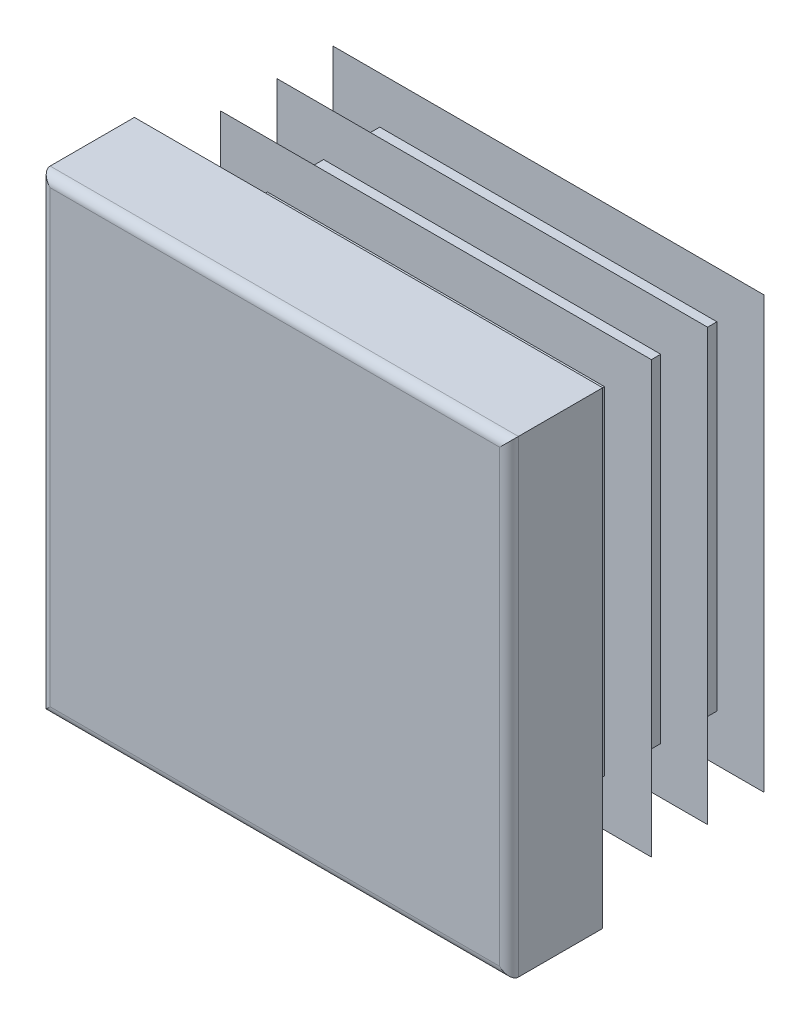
ISO-10303-21;
HEADER;
FILE_DESCRIPTION(('STEP AP214'),'2;1');
FILE_NAME('part.step','',(''),(''),'','','');
FILE_SCHEMA(('AUTOMOTIVE_DESIGN { 1 0 10303 214 1 1 1 1 }'));
ENDSEC;
DATA;
#1=APPLICATION_CONTEXT('core data for automotive mechanical design processes');
#2=APPLICATION_PROTOCOL_DEFINITION('international standard','automotive_design',2000,#1);
#3=PRODUCT_CONTEXT('',#1,'mechanical');
#4=PRODUCT('Part','Part','',(#3));
#5=PRODUCT_RELATED_PRODUCT_CATEGORY('part','',(#4));
#6=PRODUCT_DEFINITION_FORMATION('','',#4);
#7=PRODUCT_DEFINITION_CONTEXT('part definition',#1,'design');
#8=PRODUCT_DEFINITION('design','',#6,#7);
#9=PRODUCT_DEFINITION_SHAPE('','',#8);
#10=(LENGTH_UNIT() NAMED_UNIT(*) SI_UNIT(.MILLI.,.METRE.));
#11=(NAMED_UNIT(*) PLANE_ANGLE_UNIT() SI_UNIT($,.RADIAN.));
#12=(NAMED_UNIT(*) SI_UNIT($,.STERADIAN.) SOLID_ANGLE_UNIT());
#13=UNCERTAINTY_MEASURE_WITH_UNIT(LENGTH_MEASURE(1.E-05),#10,'distance_accuracy_value','');
#14=(GEOMETRIC_REPRESENTATION_CONTEXT(3) GLOBAL_UNCERTAINTY_ASSIGNED_CONTEXT((#13)) GLOBAL_UNIT_ASSIGNED_CONTEXT((#10,
#11,#12)) REPRESENTATION_CONTEXT('',''));
#15=CARTESIAN_POINT('',(0.,0.,0.));
#16=DIRECTION('',(0.,0.,1.));
#17=DIRECTION('',(1.,0.,0.));
#18=AXIS2_PLACEMENT_3D('',#15,#16,#17);
#19=CARTESIAN_POINT('',(12.,-12.5,5.));
#20=DIRECTION('',(0.,0.,-1.));
#21=DIRECTION('',(0.,1.,0.));
#22=AXIS2_PLACEMENT_3D('',#19,#20,#21);
#23=PLANE('',#22);
#24=DIRECTION('',(0.,1.,0.));
#25=VECTOR('',#24,1.);
#26=CARTESIAN_POINT('',(-12.,-12.5,5.));
#27=LINE('',#26,#25);
#28=CARTESIAN_POINT('',(-12.,-12.,5.));
#29=VERTEX_POINT('',#28);
#30=CARTESIAN_POINT('',(-12.,12.,5.));
#31=VERTEX_POINT('',#30);
#32=EDGE_CURVE('E262',#29,#31,#27,.T.);
#33=ORIENTED_EDGE('',*,*,#32,.F.);
#34=DIRECTION('',(-1.,0.,0.));
#35=VECTOR('',#34,1.);
#36=CARTESIAN_POINT('',(12.5,-12.,5.));
#37=LINE('',#36,#35);
#38=CARTESIAN_POINT('',(12.,-12.,5.));
#39=VERTEX_POINT('',#38);
#40=EDGE_CURVE('E432',#39,#29,#37,.T.);
#41=ORIENTED_EDGE('',*,*,#40,.F.);
#42=DIRECTION('',(0.,1.,0.));
#43=VECTOR('',#42,1.);
#44=CARTESIAN_POINT('',(12.,-12.5,5.));
#45=LINE('',#44,#43);
#46=CARTESIAN_POINT('',(12.,12.,5.));
#47=VERTEX_POINT('',#46);
#48=EDGE_CURVE('E257',#39,#47,#45,.T.);
#49=ORIENTED_EDGE('',*,*,#48,.T.);
#50=DIRECTION('',(-1.,0.,0.));
#51=VECTOR('',#50,1.);
#52=CARTESIAN_POINT('',(12.5,12.,5.));
#53=LINE('',#52,#51);
#54=EDGE_CURVE('E534',#47,#31,#53,.T.);
#55=ORIENTED_EDGE('',*,*,#54,.T.);
#56=EDGE_LOOP('',(#33,#41,#49,#55));
#57=FACE_BOUND('',#56,.T.);
#58=ADVANCED_FACE('F14',(#57),#23,.F.);
#59=CARTESIAN_POINT('',(-12.,-12.5,4.5));
#60=DIRECTION('',(0.,1.,0.));
#61=DIRECTION('',(-1.,0.,0.));
#62=AXIS2_PLACEMENT_3D('',#59,#60,#61);
#63=CYLINDRICAL_SURFACE('',#62,0.5);
#64=DIRECTION('',(0.,1.,0.));
#65=VECTOR('',#64,1.);
#66=CARTESIAN_POINT('',(-12.5,-12.5,4.5));
#67=LINE('',#66,#65);
#68=CARTESIAN_POINT('',(-12.5,-12.5,4.5));
#69=VERTEX_POINT('',#68);
#70=CARTESIAN_POINT('',(-12.5,12.5,4.5));
#71=VERTEX_POINT('',#70);
#72=EDGE_CURVE('E354',#69,#71,#67,.T.);
#73=ORIENTED_EDGE('',*,*,#72,.F.);
#74=CARTESIAN_POINT('',(-12.,-12.,4.5));
#75=DIRECTION('',(-0.707106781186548,0.707106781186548,0.));
#76=DIRECTION('',(0.707106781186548,0.707106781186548,0.));
#77=AXIS2_PLACEMENT_3D('',#74,#75,#76);
#78=ELLIPSE('',#77,0.707106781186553,0.5);
#79=EDGE_CURVE('E59',#69,#29,#78,.T.);
#80=ORIENTED_EDGE('',*,*,#79,.T.);
#81=ORIENTED_EDGE('',*,*,#32,.T.);
#82=CARTESIAN_POINT('',(-12.,12.,4.5));
#83=DIRECTION('',(0.707106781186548,0.707106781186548,0.));
#84=DIRECTION('',(-0.707106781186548,0.707106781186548,0.));
#85=AXIS2_PLACEMENT_3D('',#82,#83,#84);
#86=ELLIPSE('',#85,0.707106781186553,0.5);
#87=EDGE_CURVE('E258',#31,#71,#86,.F.);
#88=ORIENTED_EDGE('',*,*,#87,.T.);
#89=EDGE_LOOP('',(#73,#80,#81,#88));
#90=FACE_BOUND('',#89,.T.);
#91=ADVANCED_FACE('F16',(#90),#63,.T.);
#92=CARTESIAN_POINT('',(-12.5,-12.5,4.5));
#93=DIRECTION('',(1.,0.,0.));
#94=DIRECTION('',(0.,1.,0.));
#95=AXIS2_PLACEMENT_3D('',#92,#93,#94);
#96=PLANE('',#95);
#97=DIRECTION('',(0.,0.,-1.));
#98=VECTOR('',#97,1.);
#99=CARTESIAN_POINT('',(-12.5,12.5,4.5));
#100=LINE('',#99,#98);
#101=CARTESIAN_POINT('',(-12.5,12.5,0.));
#102=VERTEX_POINT('',#101);
#103=EDGE_CURVE('E519',#71,#102,#100,.T.);
#104=ORIENTED_EDGE('',*,*,#103,.T.);
#105=DIRECTION('',(0.,1.,0.));
#106=VECTOR('',#105,1.);
#107=CARTESIAN_POINT('',(-12.5,-12.5,0.));
#108=LINE('',#107,#106);
#109=CARTESIAN_POINT('',(-12.5,-12.5,0.));
#110=VERTEX_POINT('',#109);
#111=EDGE_CURVE('E352',#110,#102,#108,.T.);
#112=ORIENTED_EDGE('',*,*,#111,.F.);
#113=DIRECTION('',(0.,0.,-1.));
#114=VECTOR('',#113,1.);
#115=CARTESIAN_POINT('',(-12.5,-12.5,4.5));
#116=LINE('',#115,#114);
#117=EDGE_CURVE('E520',#69,#110,#116,.T.);
#118=ORIENTED_EDGE('',*,*,#117,.F.);
#119=ORIENTED_EDGE('',*,*,#72,.T.);
#120=EDGE_LOOP('',(#104,#112,#118,#119));
#121=FACE_BOUND('',#120,.T.);
#122=ADVANCED_FACE('F604',(#121),#96,.F.);
#123=CARTESIAN_POINT('',(-9.,-12.5,0.));
#124=DIRECTION('',(1.,0.,0.));
#125=DIRECTION('',(0.,1.,0.));
#126=AXIS2_PLACEMENT_3D('',#123,#124,#125);
#127=PLANE('',#126);
#128=DIRECTION('',(0.,1.,0.));
#129=VECTOR('',#128,1.);
#130=CARTESIAN_POINT('',(-9.,-12.5,0.));
#131=LINE('',#130,#129);
#132=CARTESIAN_POINT('',(-9.,-9.,0.));
#133=VERTEX_POINT('',#132);
#134=CARTESIAN_POINT('',(-9.,9.,0.));
#135=VERTEX_POINT('',#134);
#136=EDGE_CURVE('E349',#133,#135,#131,.T.);
#137=ORIENTED_EDGE('',*,*,#136,.T.);
#138=DIRECTION('',(0.,0.,-1.));
#139=VECTOR('',#138,1.);
#140=CARTESIAN_POINT('',(-9.,9.,0.));
#141=LINE('',#140,#139);
#142=CARTESIAN_POINT('',(-9.,9.,-0.6));
#143=VERTEX_POINT('',#142);
#144=EDGE_CURVE('E445',#135,#143,#141,.T.);
#145=ORIENTED_EDGE('',*,*,#144,.T.);
#146=DIRECTION('',(0.,1.,0.));
#147=VECTOR('',#146,1.);
#148=CARTESIAN_POINT('',(-9.,-12.5,-0.6));
#149=LINE('',#148,#147);
#150=CARTESIAN_POINT('',(-9.,-9.,-0.6));
#151=VERTEX_POINT('',#150);
#152=EDGE_CURVE('E346',#151,#143,#149,.T.);
#153=ORIENTED_EDGE('',*,*,#152,.F.);
#154=DIRECTION('',(0.,0.,1.));
#155=VECTOR('',#154,1.);
#156=CARTESIAN_POINT('',(-9.,-9.,0.));
#157=LINE('',#156,#155);
#158=EDGE_CURVE('E439',#151,#133,#157,.T.);
#159=ORIENTED_EDGE('',*,*,#158,.T.);
#160=EDGE_LOOP('',(#137,#145,#153,#159));
#161=FACE_BOUND('',#160,.T.);
#162=ADVANCED_FACE('F728',(#161),#127,.F.);
#163=CARTESIAN_POINT('',(-11.5,-12.5,-0.6));
#164=DIRECTION('',(0.573576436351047,0.,0.819152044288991));
#165=DIRECTION('',(-0.819152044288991,0.,0.573576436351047));
#166=AXIS2_PLACEMENT_3D('',#163,#164,#165);
#167=PLANE('',#166);
#168=DIRECTION('',(0.,1.,0.));
#169=VECTOR('',#168,1.);
#170=CARTESIAN_POINT('',(-11.5,-12.5,-0.6));
#171=LINE('',#170,#169);
#172=CARTESIAN_POINT('',(-11.5,-11.5,-0.6));
#173=VERTEX_POINT('',#172);
#174=CARTESIAN_POINT('',(-11.5,11.5,-0.6));
#175=VERTEX_POINT('',#174);
#176=EDGE_CURVE('E344',#173,#175,#171,.T.);
#177=ORIENTED_EDGE('',*,*,#176,.T.);
#178=DIRECTION('',(0.633687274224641,-0.633687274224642,-0.443712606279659));
#179=VECTOR('',#178,1.);
#180=CARTESIAN_POINT('',(-1.86257052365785,1.86257052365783,-7.34820076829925));
#181=LINE('',#180,#179);
#182=CARTESIAN_POINT('',(-9.,9.,-2.35051884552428));
#183=VERTEX_POINT('',#182);
#184=EDGE_CURVE('E457',#175,#183,#181,.T.);
#185=ORIENTED_EDGE('',*,*,#184,.T.);
#186=DIRECTION('',(0.,1.,0.));
#187=VECTOR('',#186,1.);
#188=CARTESIAN_POINT('',(-9.,-12.5,-2.35051884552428));
#189=LINE('',#188,#187);
#190=CARTESIAN_POINT('',(-9.,-9.,-2.35051884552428));
#191=VERTEX_POINT('',#190);
#192=EDGE_CURVE('E341',#191,#183,#189,.T.);
#193=ORIENTED_EDGE('',*,*,#192,.F.);
#194=DIRECTION('',(-0.633687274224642,-0.633687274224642,0.443712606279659));
#195=VECTOR('',#194,1.);
#196=CARTESIAN_POINT('',(-11.9015595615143,-11.9015595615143,-0.31882496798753));
#197=LINE('',#196,#195);
#198=EDGE_CURVE('E451',#191,#173,#197,.T.);
#199=ORIENTED_EDGE('',*,*,#198,.T.);
#200=EDGE_LOOP('',(#177,#185,#193,#199));
#201=FACE_BOUND('',#200,.T.);
#202=ADVANCED_FACE('F732',(#201),#167,.F.);
#203=CARTESIAN_POINT('',(-9.,-12.5,-2.35051884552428));
#204=DIRECTION('',(1.,0.,0.));
#205=DIRECTION('',(0.,1.,0.));
#206=AXIS2_PLACEMENT_3D('',#203,#204,#205);
#207=PLANE('',#206);
#208=ORIENTED_EDGE('',*,*,#192,.T.);
#209=DIRECTION('',(0.,0.,-1.));
#210=VECTOR('',#209,1.);
#211=CARTESIAN_POINT('',(-9.,9.,-2.35051884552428));
#212=LINE('',#211,#210);
#213=CARTESIAN_POINT('',(-9.,9.,-3.6));
#214=VERTEX_POINT('',#213);
#215=EDGE_CURVE('E463',#183,#214,#212,.T.);
#216=ORIENTED_EDGE('',*,*,#215,.T.);
#217=DIRECTION('',(0.,1.,0.));
#218=VECTOR('',#217,1.);
#219=CARTESIAN_POINT('',(-9.,-12.5,-3.6));
#220=LINE('',#219,#218);
#221=CARTESIAN_POINT('',(-9.,-9.,-3.6));
#222=VERTEX_POINT('',#221);
#223=EDGE_CURVE('E338',#222,#214,#220,.T.);
#224=ORIENTED_EDGE('',*,*,#223,.F.);
#225=DIRECTION('',(0.,0.,1.));
#226=VECTOR('',#225,1.);
#227=CARTESIAN_POINT('',(-9.,-9.,-2.35051884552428));
#228=LINE('',#227,#226);
#229=EDGE_CURVE('E460',#222,#191,#228,.T.);
#230=ORIENTED_EDGE('',*,*,#229,.T.);
#231=EDGE_LOOP('',(#208,#216,#224,#230));
#232=FACE_BOUND('',#231,.T.);
#233=ADVANCED_FACE('F738',(#232),#207,.F.);
#234=CARTESIAN_POINT('',(-11.5,-12.5,-3.6));
#235=DIRECTION('',(0.573576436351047,0.,0.819152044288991));
#236=DIRECTION('',(-0.819152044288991,0.,0.573576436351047));
#237=AXIS2_PLACEMENT_3D('',#234,#235,#236);
#238=PLANE('',#237);
#239=DIRECTION('',(0.,1.,0.));
#240=VECTOR('',#239,1.);
#241=CARTESIAN_POINT('',(-11.5,-12.5,-3.6));
#242=LINE('',#241,#240);
#243=CARTESIAN_POINT('',(-11.5,-11.5,-3.6));
#244=VERTEX_POINT('',#243);
#245=CARTESIAN_POINT('',(-11.5,11.5,-3.6));
#246=VERTEX_POINT('',#245);
#247=EDGE_CURVE('E336',#244,#246,#242,.T.);
#248=ORIENTED_EDGE('',*,*,#247,.T.);
#249=DIRECTION('',(0.633687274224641,-0.633687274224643,-0.443712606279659));
#250=VECTOR('',#249,1.);
#251=CARTESIAN_POINT('',(-1.86257052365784,1.86257052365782,-10.3482007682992));
#252=LINE('',#251,#250);
#253=CARTESIAN_POINT('',(-9.,9.,-5.35051884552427));
#254=VERTEX_POINT('',#253);
#255=EDGE_CURVE('E475',#246,#254,#252,.T.);
#256=ORIENTED_EDGE('',*,*,#255,.T.);
#257=DIRECTION('',(0.,1.,0.));
#258=VECTOR('',#257,1.);
#259=CARTESIAN_POINT('',(-9.,-12.5,-5.35051884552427));
#260=LINE('',#259,#258);
#261=CARTESIAN_POINT('',(-9.,-9.,-5.35051884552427));
#262=VERTEX_POINT('',#261);
#263=EDGE_CURVE('E333',#262,#254,#260,.T.);
#264=ORIENTED_EDGE('',*,*,#263,.F.);
#265=DIRECTION('',(-0.633687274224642,-0.633687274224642,0.443712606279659));
#266=VECTOR('',#265,1.);
#267=CARTESIAN_POINT('',(-11.9015595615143,-11.9015595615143,-3.31882496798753));
#268=LINE('',#267,#266);
#269=EDGE_CURVE('E469',#262,#244,#268,.T.);
#270=ORIENTED_EDGE('',*,*,#269,.T.);
#271=EDGE_LOOP('',(#248,#256,#264,#270));
#272=FACE_BOUND('',#271,.T.);
#273=ADVANCED_FACE('F742',(#272),#238,.F.);
#274=CARTESIAN_POINT('',(-9.,-12.5,-5.35051884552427));
#275=DIRECTION('',(1.,0.,0.));
#276=DIRECTION('',(0.,1.,0.));
#277=AXIS2_PLACEMENT_3D('',#274,#275,#276);
#278=PLANE('',#277);
#279=ORIENTED_EDGE('',*,*,#263,.T.);
#280=DIRECTION('',(0.,0.,-1.));
#281=VECTOR('',#280,1.);
#282=CARTESIAN_POINT('',(-9.,9.,-5.35051884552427));
#283=LINE('',#282,#281);
#284=CARTESIAN_POINT('',(-9.,9.,-6.6));
#285=VERTEX_POINT('',#284);
#286=EDGE_CURVE('E481',#254,#285,#283,.T.);
#287=ORIENTED_EDGE('',*,*,#286,.T.);
#288=DIRECTION('',(0.,1.,0.));
#289=VECTOR('',#288,1.);
#290=CARTESIAN_POINT('',(-9.,-12.5,-6.6));
#291=LINE('',#290,#289);
#292=CARTESIAN_POINT('',(-9.,-9.,-6.6));
#293=VERTEX_POINT('',#292);
#294=EDGE_CURVE('E330',#293,#285,#291,.T.);
#295=ORIENTED_EDGE('',*,*,#294,.F.);
#296=DIRECTION('',(0.,0.,1.));
#297=VECTOR('',#296,1.);
#298=CARTESIAN_POINT('',(-9.,-9.,-5.35051884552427));
#299=LINE('',#298,#297);
#300=EDGE_CURVE('E478',#293,#262,#299,.T.);
#301=ORIENTED_EDGE('',*,*,#300,.T.);
#302=EDGE_LOOP('',(#279,#287,#295,#301));
#303=FACE_BOUND('',#302,.T.);
#304=ADVANCED_FACE('F746',(#303),#278,.F.);
#305=CARTESIAN_POINT('',(-11.5,-12.5,-6.6));
#306=DIRECTION('',(0.573576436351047,0.,0.819152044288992));
#307=DIRECTION('',(-0.819152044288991,0.,0.573576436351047));
#308=AXIS2_PLACEMENT_3D('',#305,#306,#307);
#309=PLANE('',#308);
#310=DIRECTION('',(0.,1.,0.));
#311=VECTOR('',#310,1.);
#312=CARTESIAN_POINT('',(-11.5,-12.5,-6.6));
#313=LINE('',#312,#311);
#314=CARTESIAN_POINT('',(-11.5,-11.5,-6.6));
#315=VERTEX_POINT('',#314);
#316=CARTESIAN_POINT('',(-11.5,11.5,-6.6));
#317=VERTEX_POINT('',#316);
#318=EDGE_CURVE('E328',#315,#317,#313,.T.);
#319=ORIENTED_EDGE('',*,*,#318,.T.);
#320=DIRECTION('',(0.633687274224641,-0.633687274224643,-0.443712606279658));
#321=VECTOR('',#320,1.);
#322=CARTESIAN_POINT('',(-1.86257052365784,1.86257052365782,-13.3482007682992));
#323=LINE('',#322,#321);
#324=CARTESIAN_POINT('',(-9.,9.,-8.35051884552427));
#325=VERTEX_POINT('',#324);
#326=EDGE_CURVE('E493',#317,#325,#323,.T.);
#327=ORIENTED_EDGE('',*,*,#326,.T.);
#328=DIRECTION('',(0.,1.,0.));
#329=VECTOR('',#328,1.);
#330=CARTESIAN_POINT('',(-9.,-12.5,-8.35051884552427));
#331=LINE('',#330,#329);
#332=CARTESIAN_POINT('',(-9.,-9.,-8.35051884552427));
#333=VERTEX_POINT('',#332);
#334=EDGE_CURVE('E325',#333,#325,#331,.T.);
#335=ORIENTED_EDGE('',*,*,#334,.F.);
#336=DIRECTION('',(-0.633687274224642,-0.633687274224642,0.443712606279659));
#337=VECTOR('',#336,1.);
#338=CARTESIAN_POINT('',(-11.9015595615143,-11.9015595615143,-6.31882496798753));
#339=LINE('',#338,#337);
#340=EDGE_CURVE('E487',#333,#315,#339,.T.);
#341=ORIENTED_EDGE('',*,*,#340,.T.);
#342=EDGE_LOOP('',(#319,#327,#335,#341));
#343=FACE_BOUND('',#342,.T.);
#344=ADVANCED_FACE('F668',(#343),#309,.F.);
#345=CARTESIAN_POINT('',(-9.,-12.5,-8.35051884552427));
#346=DIRECTION('',(1.,0.,0.));
#347=DIRECTION('',(0.,1.,0.));
#348=AXIS2_PLACEMENT_3D('',#345,#346,#347);
#349=PLANE('',#348);
#350=ORIENTED_EDGE('',*,*,#334,.T.);
#351=DIRECTION('',(0.,0.,-1.));
#352=VECTOR('',#351,1.);
#353=CARTESIAN_POINT('',(-9.,9.,-8.35051884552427));
#354=LINE('',#353,#352);
#355=CARTESIAN_POINT('',(-9.,9.,-9.6));
#356=VERTEX_POINT('',#355);
#357=EDGE_CURVE('E499',#325,#356,#354,.T.);
#358=ORIENTED_EDGE('',*,*,#357,.T.);
#359=DIRECTION('',(0.,1.,0.));
#360=VECTOR('',#359,1.);
#361=CARTESIAN_POINT('',(-9.,-12.5,-9.6));
#362=LINE('',#361,#360);
#363=CARTESIAN_POINT('',(-9.,-9.,-9.6));
#364=VERTEX_POINT('',#363);
#365=EDGE_CURVE('E322',#364,#356,#362,.T.);
#366=ORIENTED_EDGE('',*,*,#365,.F.);
#367=DIRECTION('',(0.,0.,1.));
#368=VECTOR('',#367,1.);
#369=CARTESIAN_POINT('',(-9.,-9.,-8.35051884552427));
#370=LINE('',#369,#368);
#371=EDGE_CURVE('E496',#364,#333,#370,.T.);
#372=ORIENTED_EDGE('',*,*,#371,.T.);
#373=EDGE_LOOP('',(#350,#358,#366,#372));
#374=FACE_BOUND('',#373,.T.);
#375=ADVANCED_FACE('F665',(#374),#349,.F.);
#376=CARTESIAN_POINT('',(-11.5,-12.5,-9.6));
#377=DIRECTION('',(0.573576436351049,0.,0.81915204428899));
#378=DIRECTION('',(-0.81915204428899,0.,0.573576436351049));
#379=AXIS2_PLACEMENT_3D('',#376,#377,#378);
#380=PLANE('',#379);
#381=DIRECTION('',(0.,1.,0.));
#382=VECTOR('',#381,1.);
#383=CARTESIAN_POINT('',(-11.5,-12.5,-9.6));
#384=LINE('',#383,#382);
#385=CARTESIAN_POINT('',(-11.5,-11.5,-9.6));
#386=VERTEX_POINT('',#385);
#387=CARTESIAN_POINT('',(-11.5,11.5,-9.6));
#388=VERTEX_POINT('',#387);
#389=EDGE_CURVE('E320',#386,#388,#384,.T.);
#390=ORIENTED_EDGE('',*,*,#389,.T.);
#391=DIRECTION('',(0.63368727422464,-0.633687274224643,-0.44371260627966));
#392=VECTOR('',#391,1.);
#393=CARTESIAN_POINT('',(-1.86257052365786,1.8625705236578,-16.3482007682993));
#394=LINE('',#393,#392);
#395=CARTESIAN_POINT('',(-9.,9.,-11.3505188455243));
#396=VERTEX_POINT('',#395);
#397=EDGE_CURVE('E511',#388,#396,#394,.T.);
#398=ORIENTED_EDGE('',*,*,#397,.T.);
#399=DIRECTION('',(0.,1.,0.));
#400=VECTOR('',#399,1.);
#401=CARTESIAN_POINT('',(-9.,-12.5,-11.3505188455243));
#402=LINE('',#401,#400);
#403=CARTESIAN_POINT('',(-9.,-9.,-11.3505188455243));
#404=VERTEX_POINT('',#403);
#405=EDGE_CURVE('E317',#404,#396,#402,.T.);
#406=ORIENTED_EDGE('',*,*,#405,.F.);
#407=DIRECTION('',(-0.633687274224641,-0.633687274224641,0.443712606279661));
#408=VECTOR('',#407,1.);
#409=CARTESIAN_POINT('',(-11.9015595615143,-11.9015595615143,-9.31882496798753));
#410=LINE('',#409,#408);
#411=EDGE_CURVE('E505',#404,#386,#410,.T.);
#412=ORIENTED_EDGE('',*,*,#411,.T.);
#413=EDGE_LOOP('',(#390,#398,#406,#412));
#414=FACE_BOUND('',#413,.T.);
#415=ADVANCED_FACE('F580',(#414),#380,.F.);
#416=CARTESIAN_POINT('',(-9.,-12.5,-11.3505188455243));
#417=DIRECTION('',(1.,0.,0.));
#418=DIRECTION('',(0.,1.,0.));
#419=AXIS2_PLACEMENT_3D('',#416,#417,#418);
#420=PLANE('',#419);
#421=ORIENTED_EDGE('',*,*,#405,.T.);
#422=DIRECTION('',(0.,0.,-1.));
#423=VECTOR('',#422,1.);
#424=CARTESIAN_POINT('',(-9.,9.,-11.3505188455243));
#425=LINE('',#424,#423);
#426=CARTESIAN_POINT('',(-9.,9.,-12.));
#427=VERTEX_POINT('',#426);
#428=EDGE_CURVE('E517',#396,#427,#425,.T.);
#429=ORIENTED_EDGE('',*,*,#428,.T.);
#430=DIRECTION('',(0.,1.,0.));
#431=VECTOR('',#430,1.);
#432=CARTESIAN_POINT('',(-9.,-12.5,-12.));
#433=LINE('',#432,#431);
#434=CARTESIAN_POINT('',(-9.,-9.,-12.));
#435=VERTEX_POINT('',#434);
#436=EDGE_CURVE('E314',#435,#427,#433,.T.);
#437=ORIENTED_EDGE('',*,*,#436,.F.);
#438=DIRECTION('',(0.,0.,1.));
#439=VECTOR('',#438,1.);
#440=CARTESIAN_POINT('',(-9.,-9.,-11.3505188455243));
#441=LINE('',#440,#439);
#442=EDGE_CURVE('E514',#435,#404,#441,.T.);
#443=ORIENTED_EDGE('',*,*,#442,.T.);
#444=EDGE_LOOP('',(#421,#429,#437,#443));
#445=FACE_BOUND('',#444,.T.);
#446=ADVANCED_FACE('F582',(#445),#420,.F.);
#447=CARTESIAN_POINT('',(-9.,-12.5,-12.));
#448=DIRECTION('',(0.,0.,1.));
#449=DIRECTION('',(0.,-1.,0.));
#450=AXIS2_PLACEMENT_3D('',#447,#448,#449);
#451=PLANE('',#450);
#452=ORIENTED_EDGE('',*,*,#436,.T.);
#453=DIRECTION('',(-1.,0.,0.));
#454=VECTOR('',#453,1.);
#455=CARTESIAN_POINT('',(12.5,9.,-12.));
#456=LINE('',#455,#454);
#457=CARTESIAN_POINT('',(9.,9.,-12.));
#458=VERTEX_POINT('',#457);
#459=EDGE_CURVE('E388',#458,#427,#456,.T.);
#460=ORIENTED_EDGE('',*,*,#459,.F.);
#461=DIRECTION('',(0.,1.,0.));
#462=VECTOR('',#461,1.);
#463=CARTESIAN_POINT('',(9.,-12.5,-12.));
#464=LINE('',#463,#462);
#465=CARTESIAN_POINT('',(9.,-9.,-12.));
#466=VERTEX_POINT('',#465);
#467=EDGE_CURVE('E311',#466,#458,#464,.T.);
#468=ORIENTED_EDGE('',*,*,#467,.F.);
#469=DIRECTION('',(-1.,0.,0.));
#470=VECTOR('',#469,1.);
#471=CARTESIAN_POINT('',(12.5,-9.,-12.));
#472=LINE('',#471,#470);
#473=EDGE_CURVE('E386',#466,#435,#472,.T.);
#474=ORIENTED_EDGE('',*,*,#473,.T.);
#475=EDGE_LOOP('',(#452,#460,#468,#474));
#476=FACE_BOUND('',#475,.T.);
#477=ADVANCED_FACE('F385',(#476),#451,.F.);
#478=CARTESIAN_POINT('',(9.,-12.5,-12.));
#479=DIRECTION('',(-1.,0.,0.));
#480=DIRECTION('',(0.,-1.,0.));
#481=AXIS2_PLACEMENT_3D('',#478,#479,#480);
#482=PLANE('',#481);
#483=ORIENTED_EDGE('',*,*,#467,.T.);
#484=DIRECTION('',(0.,0.,1.));
#485=VECTOR('',#484,1.);
#486=CARTESIAN_POINT('',(9.,9.,-12.));
#487=LINE('',#486,#485);
#488=CARTESIAN_POINT('',(9.,9.,-11.3505188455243));
#489=VERTEX_POINT('',#488);
#490=EDGE_CURVE('E9',#458,#489,#487,.T.);
#491=ORIENTED_EDGE('',*,*,#490,.T.);
#492=DIRECTION('',(0.,1.,0.));
#493=VECTOR('',#492,1.);
#494=CARTESIAN_POINT('',(9.,-12.5,-11.3505188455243));
#495=LINE('',#494,#493);
#496=CARTESIAN_POINT('',(9.,-9.,-11.3505188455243));
#497=VERTEX_POINT('',#496);
#498=EDGE_CURVE('E308',#497,#489,#495,.T.);
#499=ORIENTED_EDGE('',*,*,#498,.F.);
#500=DIRECTION('',(0.,0.,-1.));
#501=VECTOR('',#500,1.);
#502=CARTESIAN_POINT('',(9.,-9.,-12.));
#503=LINE('',#502,#501);
#504=EDGE_CURVE('E23',#497,#466,#503,.T.);
#505=ORIENTED_EDGE('',*,*,#504,.T.);
#506=EDGE_LOOP('',(#483,#491,#499,#505));
#507=FACE_BOUND('',#506,.T.);
#508=ADVANCED_FACE('F378',(#507),#482,.F.);
#509=CARTESIAN_POINT('',(9.,-12.5,-11.3505188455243));
#510=DIRECTION('',(-0.573576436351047,0.,0.819152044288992));
#511=DIRECTION('',(-0.819152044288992,0.,-0.573576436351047));
#512=AXIS2_PLACEMENT_3D('',#509,#510,#511);
#513=PLANE('',#512);
#514=ORIENTED_EDGE('',*,*,#498,.T.);
#515=DIRECTION('',(0.633687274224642,0.633687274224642,0.443712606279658));
#516=VECTOR('',#515,1.);
#517=CARTESIAN_POINT('',(0.366469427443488,0.366469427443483,-17.3957820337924));
#518=LINE('',#517,#516);
#519=CARTESIAN_POINT('',(11.5,11.5,-9.6));
#520=VERTEX_POINT('',#519);
#521=EDGE_CURVE('E508',#489,#520,#518,.T.);
#522=ORIENTED_EDGE('',*,*,#521,.T.);
#523=DIRECTION('',(0.,1.,0.));
#524=VECTOR('',#523,1.);
#525=CARTESIAN_POINT('',(11.5,-12.5,-9.6));
#526=LINE('',#525,#524);
#527=CARTESIAN_POINT('',(11.5,-11.5,-9.6));
#528=VERTEX_POINT('',#527);
#529=EDGE_CURVE('E305',#528,#520,#526,.T.);
#530=ORIENTED_EDGE('',*,*,#529,.F.);
#531=DIRECTION('',(-0.633687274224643,0.63368727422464,-0.443712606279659));
#532=VECTOR('',#531,1.);
#533=CARTESIAN_POINT('',(10.4054584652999,-10.4054584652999,-10.3664062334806));
#534=LINE('',#533,#532);
#535=EDGE_CURVE('E502',#528,#497,#534,.T.);
#536=ORIENTED_EDGE('',*,*,#535,.T.);
#537=EDGE_LOOP('',(#514,#522,#530,#536));
#538=FACE_BOUND('',#537,.T.);
#539=ADVANCED_FACE('F588',(#538),#513,.F.);
#540=CARTESIAN_POINT('',(11.5,-12.5,-9.6));
#541=DIRECTION('',(0.,0.,-1.));
#542=DIRECTION('',(0.,1.,0.));
#543=AXIS2_PLACEMENT_3D('',#540,#541,#542);
#544=PLANE('',#543);
#545=ORIENTED_EDGE('',*,*,#529,.T.);
#546=DIRECTION('',(-1.,0.,0.));
#547=VECTOR('',#546,1.);
#548=CARTESIAN_POINT('',(12.5,11.5,-9.6));
#549=LINE('',#548,#547);
#550=EDGE_CURVE('E394',#520,#388,#549,.T.);
#551=ORIENTED_EDGE('',*,*,#550,.T.);
#552=ORIENTED_EDGE('',*,*,#389,.F.);
#553=DIRECTION('',(-1.,0.,0.));
#554=VECTOR('',#553,1.);
#555=CARTESIAN_POINT('',(12.5,-11.5,-9.6));
#556=LINE('',#555,#554);
#557=EDGE_CURVE('E401',#528,#386,#556,.T.);
#558=ORIENTED_EDGE('',*,*,#557,.F.);
#559=EDGE_LOOP('',(#545,#551,#552,#558));
#560=FACE_BOUND('',#559,.T.);
#561=ORIENTED_EDGE('',*,*,#365,.T.);
#562=DIRECTION('',(-1.,0.,0.));
#563=VECTOR('',#562,1.);
#564=CARTESIAN_POINT('',(12.5,9.,-9.6));
#565=LINE('',#564,#563);
#566=CARTESIAN_POINT('',(9.,9.,-9.6));
#567=VERTEX_POINT('',#566);
#568=EDGE_CURVE('E567',#567,#356,#565,.T.);
#569=ORIENTED_EDGE('',*,*,#568,.F.);
#570=DIRECTION('',(0.,1.,0.));
#571=VECTOR('',#570,1.);
#572=CARTESIAN_POINT('',(9.,-12.5,-9.6));
#573=LINE('',#572,#571);
#574=CARTESIAN_POINT('',(9.,-9.,-9.6));
#575=VERTEX_POINT('',#574);
#576=EDGE_CURVE('E302',#575,#567,#573,.T.);
#577=ORIENTED_EDGE('',*,*,#576,.F.);
#578=DIRECTION('',(-1.,0.,0.));
#579=VECTOR('',#578,1.);
#580=CARTESIAN_POINT('',(12.5,-9.,-9.6));
#581=LINE('',#580,#579);
#582=EDGE_CURVE('E403',#575,#364,#581,.T.);
#583=ORIENTED_EDGE('',*,*,#582,.T.);
#584=EDGE_LOOP('',(#561,#569,#577,#583));
#585=FACE_BOUND('',#584,.T.);
#586=ADVANCED_FACE('F571',(#560,#585),#544,.F.);
#587=CARTESIAN_POINT('',(9.,-12.5,-9.6));
#588=DIRECTION('',(-1.,0.,0.));
#589=DIRECTION('',(0.,-1.,0.));
#590=AXIS2_PLACEMENT_3D('',#587,#588,#589);
#591=PLANE('',#590);
#592=ORIENTED_EDGE('',*,*,#576,.T.);
#593=DIRECTION('',(0.,0.,1.));
#594=VECTOR('',#593,1.);
#595=CARTESIAN_POINT('',(9.,9.,-9.6));
#596=LINE('',#595,#594);
#597=CARTESIAN_POINT('',(9.,9.,-8.35051884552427));
#598=VERTEX_POINT('',#597);
#599=EDGE_CURVE('E372',#567,#598,#596,.T.);
#600=ORIENTED_EDGE('',*,*,#599,.T.);
#601=DIRECTION('',(0.,1.,0.));
#602=VECTOR('',#601,1.);
#603=CARTESIAN_POINT('',(9.,-12.5,-8.35051884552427));
#604=LINE('',#603,#602);
#605=CARTESIAN_POINT('',(9.,-9.,-8.35051884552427));
#606=VERTEX_POINT('',#605);
#607=EDGE_CURVE('E299',#606,#598,#604,.T.);
#608=ORIENTED_EDGE('',*,*,#607,.F.);
#609=DIRECTION('',(0.,0.,-1.));
#610=VECTOR('',#609,1.);
#611=CARTESIAN_POINT('',(9.,-9.,-9.6));
#612=LINE('',#611,#610);
#613=EDGE_CURVE('E369',#606,#575,#612,.T.);
#614=ORIENTED_EDGE('',*,*,#613,.T.);
#615=EDGE_LOOP('',(#592,#600,#608,#614));
#616=FACE_BOUND('',#615,.T.);
#617=ADVANCED_FACE('F596',(#616),#591,.F.);
#618=CARTESIAN_POINT('',(9.,-12.5,-8.35051884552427));
#619=DIRECTION('',(-0.573576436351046,0.,0.819152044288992));
#620=DIRECTION('',(-0.819152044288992,0.,-0.573576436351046));
#621=AXIS2_PLACEMENT_3D('',#618,#619,#620);
#622=PLANE('',#621);
#623=ORIENTED_EDGE('',*,*,#607,.T.);
#624=DIRECTION('',(0.633687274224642,0.633687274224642,0.443712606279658));
#625=VECTOR('',#624,1.);
#626=CARTESIAN_POINT('',(0.366469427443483,0.366469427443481,-14.3957820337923));
#627=LINE('',#626,#625);
#628=CARTESIAN_POINT('',(11.5,11.5,-6.6));
#629=VERTEX_POINT('',#628);
#630=EDGE_CURVE('E490',#598,#629,#627,.T.);
#631=ORIENTED_EDGE('',*,*,#630,.T.);
#632=DIRECTION('',(0.,1.,0.));
#633=VECTOR('',#632,1.);
#634=CARTESIAN_POINT('',(11.5,-12.5,-6.6));
#635=LINE('',#634,#633);
#636=CARTESIAN_POINT('',(11.5,-11.5,-6.6));
#637=VERTEX_POINT('',#636);
#638=EDGE_CURVE('E296',#637,#629,#635,.T.);
#639=ORIENTED_EDGE('',*,*,#638,.F.);
#640=DIRECTION('',(-0.633687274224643,0.633687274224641,-0.443712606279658));
#641=VECTOR('',#640,1.);
#642=CARTESIAN_POINT('',(10.4054584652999,-10.4054584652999,-7.36640623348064));
#643=LINE('',#642,#641);
#644=EDGE_CURVE('E484',#637,#606,#643,.T.);
#645=ORIENTED_EDGE('',*,*,#644,.T.);
#646=EDGE_LOOP('',(#623,#631,#639,#645));
#647=FACE_BOUND('',#646,.T.);
#648=ADVANCED_FACE('F648',(#647),#622,.F.);
#649=CARTESIAN_POINT('',(11.5,-12.5,-6.6));
#650=DIRECTION('',(0.,0.,-1.));
#651=DIRECTION('',(0.,1.,0.));
#652=AXIS2_PLACEMENT_3D('',#649,#650,#651);
#653=PLANE('',#652);
#654=ORIENTED_EDGE('',*,*,#638,.T.);
#655=DIRECTION('',(-1.,0.,0.));
#656=VECTOR('',#655,1.);
#657=CARTESIAN_POINT('',(12.5,11.5,-6.6));
#658=LINE('',#657,#656);
#659=EDGE_CURVE('E561',#629,#317,#658,.T.);
#660=ORIENTED_EDGE('',*,*,#659,.T.);
#661=ORIENTED_EDGE('',*,*,#318,.F.);
#662=DIRECTION('',(-1.,0.,0.));
#663=VECTOR('',#662,1.);
#664=CARTESIAN_POINT('',(12.5,-11.5,-6.6));
#665=LINE('',#664,#663);
#666=EDGE_CURVE('E409',#637,#315,#665,.T.);
#667=ORIENTED_EDGE('',*,*,#666,.F.);
#668=EDGE_LOOP('',(#654,#660,#661,#667));
#669=FACE_BOUND('',#668,.T.);
#670=ORIENTED_EDGE('',*,*,#294,.T.);
#671=DIRECTION('',(-1.,0.,0.));
#672=VECTOR('',#671,1.);
#673=CARTESIAN_POINT('',(12.5,9.,-6.6));
#674=LINE('',#673,#672);
#675=CARTESIAN_POINT('',(9.,9.,-6.6));
#676=VERTEX_POINT('',#675);
#677=EDGE_CURVE('E559',#676,#285,#674,.T.);
#678=ORIENTED_EDGE('',*,*,#677,.F.);
#679=DIRECTION('',(0.,1.,0.));
#680=VECTOR('',#679,1.);
#681=CARTESIAN_POINT('',(9.,-12.5,-6.6));
#682=LINE('',#681,#680);
#683=CARTESIAN_POINT('',(9.,-9.,-6.6));
#684=VERTEX_POINT('',#683);
#685=EDGE_CURVE('E293',#684,#676,#682,.T.);
#686=ORIENTED_EDGE('',*,*,#685,.F.);
#687=DIRECTION('',(-1.,0.,0.));
#688=VECTOR('',#687,1.);
#689=CARTESIAN_POINT('',(12.5,-9.,-6.6));
#690=LINE('',#689,#688);
#691=EDGE_CURVE('E411',#684,#293,#690,.T.);
#692=ORIENTED_EDGE('',*,*,#691,.T.);
#693=EDGE_LOOP('',(#670,#678,#686,#692));
#694=FACE_BOUND('',#693,.T.);
#695=ADVANCED_FACE('F644',(#669,#694),#653,.F.);
#696=CARTESIAN_POINT('',(9.,-12.5,-6.6));
#697=DIRECTION('',(-1.,0.,0.));
#698=DIRECTION('',(0.,-1.,0.));
#699=AXIS2_PLACEMENT_3D('',#696,#697,#698);
#700=PLANE('',#699);
#701=ORIENTED_EDGE('',*,*,#685,.T.);
#702=DIRECTION('',(0.,0.,1.));
#703=VECTOR('',#702,1.);
#704=CARTESIAN_POINT('',(9.,9.,-6.6));
#705=LINE('',#704,#703);
#706=CARTESIAN_POINT('',(9.,9.,-5.35051884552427));
#707=VERTEX_POINT('',#706);
#708=EDGE_CURVE('E366',#676,#707,#705,.T.);
#709=ORIENTED_EDGE('',*,*,#708,.T.);
#710=DIRECTION('',(0.,1.,0.));
#711=VECTOR('',#710,1.);
#712=CARTESIAN_POINT('',(9.,-12.5,-5.35051884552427));
#713=LINE('',#712,#711);
#714=CARTESIAN_POINT('',(9.,-9.,-5.35051884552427));
#715=VERTEX_POINT('',#714);
#716=EDGE_CURVE('E290',#715,#707,#713,.T.);
#717=ORIENTED_EDGE('',*,*,#716,.F.);
#718=DIRECTION('',(0.,0.,-1.));
#719=VECTOR('',#718,1.);
#720=CARTESIAN_POINT('',(9.,-9.,-6.6));
#721=LINE('',#720,#719);
#722=EDGE_CURVE('E363',#715,#684,#721,.T.);
#723=ORIENTED_EDGE('',*,*,#722,.T.);
#724=EDGE_LOOP('',(#701,#709,#717,#723));
#725=FACE_BOUND('',#724,.T.);
#726=ADVANCED_FACE('F640',(#725),#700,.F.);
#727=CARTESIAN_POINT('',(9.,-12.5,-5.35051884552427));
#728=DIRECTION('',(-0.573576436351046,0.,0.819152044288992));
#729=DIRECTION('',(-0.819152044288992,0.,-0.573576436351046));
#730=AXIS2_PLACEMENT_3D('',#727,#728,#729);
#731=PLANE('',#730);
#732=ORIENTED_EDGE('',*,*,#716,.T.);
#733=DIRECTION('',(0.633687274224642,0.633687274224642,0.443712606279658));
#734=VECTOR('',#733,1.);
#735=CARTESIAN_POINT('',(0.366469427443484,0.366469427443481,-11.3957820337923));
#736=LINE('',#735,#734);
#737=CARTESIAN_POINT('',(11.5,11.5,-3.6));
#738=VERTEX_POINT('',#737);
#739=EDGE_CURVE('E472',#707,#738,#736,.T.);
#740=ORIENTED_EDGE('',*,*,#739,.T.);
#741=DIRECTION('',(0.,1.,0.));
#742=VECTOR('',#741,1.);
#743=CARTESIAN_POINT('',(11.5,-12.5,-3.6));
#744=LINE('',#743,#742);
#745=CARTESIAN_POINT('',(11.5,-11.5,-3.6));
#746=VERTEX_POINT('',#745);
#747=EDGE_CURVE('E287',#746,#738,#744,.T.);
#748=ORIENTED_EDGE('',*,*,#747,.F.);
#749=DIRECTION('',(-0.633687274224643,0.633687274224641,-0.443712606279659));
#750=VECTOR('',#749,1.);
#751=CARTESIAN_POINT('',(10.4054584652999,-10.4054584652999,-4.36640623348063));
#752=LINE('',#751,#750);
#753=EDGE_CURVE('E466',#746,#715,#752,.T.);
#754=ORIENTED_EDGE('',*,*,#753,.T.);
#755=EDGE_LOOP('',(#732,#740,#748,#754));
#756=FACE_BOUND('',#755,.T.);
#757=ADVANCED_FACE('F636',(#756),#731,.F.);
#758=CARTESIAN_POINT('',(11.5,-12.5,-3.6));
#759=DIRECTION('',(0.,0.,-1.));
#760=DIRECTION('',(0.,1.,0.));
#761=AXIS2_PLACEMENT_3D('',#758,#759,#760);
#762=PLANE('',#761);
#763=ORIENTED_EDGE('',*,*,#747,.T.);
#764=DIRECTION('',(-1.,0.,0.));
#765=VECTOR('',#764,1.);
#766=CARTESIAN_POINT('',(12.5,11.5,-3.6));
#767=LINE('',#766,#765);
#768=EDGE_CURVE('E553',#738,#246,#767,.T.);
#769=ORIENTED_EDGE('',*,*,#768,.T.);
#770=ORIENTED_EDGE('',*,*,#247,.F.);
#771=DIRECTION('',(-1.,0.,0.));
#772=VECTOR('',#771,1.);
#773=CARTESIAN_POINT('',(12.5,-11.5,-3.6));
#774=LINE('',#773,#772);
#775=EDGE_CURVE('E417',#746,#244,#774,.T.);
#776=ORIENTED_EDGE('',*,*,#775,.F.);
#777=EDGE_LOOP('',(#763,#769,#770,#776));
#778=FACE_BOUND('',#777,.T.);
#779=ORIENTED_EDGE('',*,*,#223,.T.);
#780=DIRECTION('',(-1.,0.,0.));
#781=VECTOR('',#780,1.);
#782=CARTESIAN_POINT('',(12.5,9.,-3.6));
#783=LINE('',#782,#781);
#784=CARTESIAN_POINT('',(9.,9.,-3.6));
#785=VERTEX_POINT('',#784);
#786=EDGE_CURVE('E551',#785,#214,#783,.T.);
#787=ORIENTED_EDGE('',*,*,#786,.F.);
#788=DIRECTION('',(0.,1.,0.));
#789=VECTOR('',#788,1.);
#790=CARTESIAN_POINT('',(9.,-12.5,-3.6));
#791=LINE('',#790,#789);
#792=CARTESIAN_POINT('',(9.,-9.,-3.6));
#793=VERTEX_POINT('',#792);
#794=EDGE_CURVE('E284',#793,#785,#791,.T.);
#795=ORIENTED_EDGE('',*,*,#794,.F.);
#796=DIRECTION('',(-1.,0.,0.));
#797=VECTOR('',#796,1.);
#798=CARTESIAN_POINT('',(12.5,-9.,-3.6));
#799=LINE('',#798,#797);
#800=EDGE_CURVE('E419',#793,#222,#799,.T.);
#801=ORIENTED_EDGE('',*,*,#800,.T.);
#802=EDGE_LOOP('',(#779,#787,#795,#801));
#803=FACE_BOUND('',#802,.T.);
#804=ADVANCED_FACE('F632',(#778,#803),#762,.F.);
#805=CARTESIAN_POINT('',(9.,-12.5,-3.6));
#806=DIRECTION('',(-1.,0.,0.));
#807=DIRECTION('',(0.,-1.,0.));
#808=AXIS2_PLACEMENT_3D('',#805,#806,#807);
#809=PLANE('',#808);
#810=ORIENTED_EDGE('',*,*,#794,.T.);
#811=DIRECTION('',(0.,0.,1.));
#812=VECTOR('',#811,1.);
#813=CARTESIAN_POINT('',(9.,9.,-3.6));
#814=LINE('',#813,#812);
#815=CARTESIAN_POINT('',(9.,9.,-2.35051884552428));
#816=VERTEX_POINT('',#815);
#817=EDGE_CURVE('E360',#785,#816,#814,.T.);
#818=ORIENTED_EDGE('',*,*,#817,.T.);
#819=DIRECTION('',(0.,1.,0.));
#820=VECTOR('',#819,1.);
#821=CARTESIAN_POINT('',(9.,-12.5,-2.35051884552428));
#822=LINE('',#821,#820);
#823=CARTESIAN_POINT('',(9.,-9.,-2.35051884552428));
#824=VERTEX_POINT('',#823);
#825=EDGE_CURVE('E281',#824,#816,#822,.T.);
#826=ORIENTED_EDGE('',*,*,#825,.F.);
#827=DIRECTION('',(0.,0.,-1.));
#828=VECTOR('',#827,1.);
#829=CARTESIAN_POINT('',(9.,-9.,-3.6));
#830=LINE('',#829,#828);
#831=EDGE_CURVE('E357',#824,#793,#830,.T.);
#832=ORIENTED_EDGE('',*,*,#831,.T.);
#833=EDGE_LOOP('',(#810,#818,#826,#832));
#834=FACE_BOUND('',#833,.T.);
#835=ADVANCED_FACE('F628',(#834),#809,.F.);
#836=CARTESIAN_POINT('',(9.,-12.5,-2.35051884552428));
#837=DIRECTION('',(-0.573576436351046,0.,0.819152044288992));
#838=DIRECTION('',(-0.819152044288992,0.,-0.573576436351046));
#839=AXIS2_PLACEMENT_3D('',#836,#837,#838);
#840=PLANE('',#839);
#841=ORIENTED_EDGE('',*,*,#825,.T.);
#842=DIRECTION('',(0.633687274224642,0.633687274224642,0.443712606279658));
#843=VECTOR('',#842,1.);
#844=CARTESIAN_POINT('',(0.366469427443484,0.366469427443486,-8.39578203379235));
#845=LINE('',#844,#843);
#846=CARTESIAN_POINT('',(11.5,11.5,-0.6));
#847=VERTEX_POINT('',#846);
#848=EDGE_CURVE('E454',#816,#847,#845,.T.);
#849=ORIENTED_EDGE('',*,*,#848,.T.);
#850=DIRECTION('',(0.,1.,0.));
#851=VECTOR('',#850,1.);
#852=CARTESIAN_POINT('',(11.5,-12.5,-0.6));
#853=LINE('',#852,#851);
#854=CARTESIAN_POINT('',(11.5,-11.5,-0.6));
#855=VERTEX_POINT('',#854);
#856=EDGE_CURVE('E278',#855,#847,#853,.T.);
#857=ORIENTED_EDGE('',*,*,#856,.F.);
#858=DIRECTION('',(-0.633687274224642,0.633687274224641,-0.443712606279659));
#859=VECTOR('',#858,1.);
#860=CARTESIAN_POINT('',(10.4054584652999,-10.4054584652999,-1.36640623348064));
#861=LINE('',#860,#859);
#862=EDGE_CURVE('E448',#855,#824,#861,.T.);
#863=ORIENTED_EDGE('',*,*,#862,.T.);
#864=EDGE_LOOP('',(#841,#849,#857,#863));
#865=FACE_BOUND('',#864,.T.);
#866=ADVANCED_FACE('F624',(#865),#840,.F.);
#867=CARTESIAN_POINT('',(11.5,-12.5,-0.6));
#868=DIRECTION('',(0.,0.,-1.));
#869=DIRECTION('',(0.,1.,0.));
#870=AXIS2_PLACEMENT_3D('',#867,#868,#869);
#871=PLANE('',#870);
#872=ORIENTED_EDGE('',*,*,#856,.T.);
#873=DIRECTION('',(-1.,0.,0.));
#874=VECTOR('',#873,1.);
#875=CARTESIAN_POINT('',(12.5,11.5,-0.6));
#876=LINE('',#875,#874);
#877=EDGE_CURVE('E545',#847,#175,#876,.T.);
#878=ORIENTED_EDGE('',*,*,#877,.T.);
#879=ORIENTED_EDGE('',*,*,#176,.F.);
#880=DIRECTION('',(-1.,0.,0.));
#881=VECTOR('',#880,1.);
#882=CARTESIAN_POINT('',(12.5,-11.5,-0.6));
#883=LINE('',#882,#881);
#884=EDGE_CURVE('E425',#855,#173,#883,.T.);
#885=ORIENTED_EDGE('',*,*,#884,.F.);
#886=EDGE_LOOP('',(#872,#878,#879,#885));
#887=FACE_BOUND('',#886,.T.);
#888=ORIENTED_EDGE('',*,*,#152,.T.);
#889=DIRECTION('',(-1.,0.,0.));
#890=VECTOR('',#889,1.);
#891=CARTESIAN_POINT('',(12.5,9.,-0.6));
#892=LINE('',#891,#890);
#893=CARTESIAN_POINT('',(9.,9.,-0.6));
#894=VERTEX_POINT('',#893);
#895=EDGE_CURVE('E543',#894,#143,#892,.T.);
#896=ORIENTED_EDGE('',*,*,#895,.F.);
#897=DIRECTION('',(0.,1.,0.));
#898=VECTOR('',#897,1.);
#899=CARTESIAN_POINT('',(9.,-12.5,-0.6));
#900=LINE('',#899,#898);
#901=CARTESIAN_POINT('',(9.,-9.,-0.6));
#902=VERTEX_POINT('',#901);
#903=EDGE_CURVE('E275',#902,#894,#900,.T.);
#904=ORIENTED_EDGE('',*,*,#903,.F.);
#905=DIRECTION('',(-1.,0.,0.));
#906=VECTOR('',#905,1.);
#907=CARTESIAN_POINT('',(12.5,-9.,-0.6));
#908=LINE('',#907,#906);
#909=EDGE_CURVE('E427',#902,#151,#908,.T.);
#910=ORIENTED_EDGE('',*,*,#909,.T.);
#911=EDGE_LOOP('',(#888,#896,#904,#910));
#912=FACE_BOUND('',#911,.T.);
#913=ADVANCED_FACE('F620',(#887,#912),#871,.F.);
#914=CARTESIAN_POINT('',(9.,-12.5,-0.6));
#915=DIRECTION('',(-1.,0.,0.));
#916=DIRECTION('',(0.,-1.,0.));
#917=AXIS2_PLACEMENT_3D('',#914,#915,#916);
#918=PLANE('',#917);
#919=ORIENTED_EDGE('',*,*,#903,.T.);
#920=DIRECTION('',(0.,0.,1.));
#921=VECTOR('',#920,1.);
#922=CARTESIAN_POINT('',(9.,9.,-0.6));
#923=LINE('',#922,#921);
#924=CARTESIAN_POINT('',(9.,9.,0.));
#925=VERTEX_POINT('',#924);
#926=EDGE_CURVE('E442',#894,#925,#923,.T.);
#927=ORIENTED_EDGE('',*,*,#926,.T.);
#928=DIRECTION('',(0.,1.,0.));
#929=VECTOR('',#928,1.);
#930=CARTESIAN_POINT('',(9.,-12.5,0.));
#931=LINE('',#930,#929);
#932=CARTESIAN_POINT('',(9.,-9.,0.));
#933=VERTEX_POINT('',#932);
#934=EDGE_CURVE('E268',#933,#925,#931,.T.);
#935=ORIENTED_EDGE('',*,*,#934,.F.);
#936=DIRECTION('',(0.,0.,-1.));
#937=VECTOR('',#936,1.);
#938=CARTESIAN_POINT('',(9.,-9.,-0.6));
#939=LINE('',#938,#937);
#940=EDGE_CURVE('E436',#933,#902,#939,.T.);
#941=ORIENTED_EDGE('',*,*,#940,.T.);
#942=EDGE_LOOP('',(#919,#927,#935,#941));
#943=FACE_BOUND('',#942,.T.);
#944=ADVANCED_FACE('F616',(#943),#918,.F.);
#945=CARTESIAN_POINT('',(9.,-12.5,0.));
#946=DIRECTION('',(0.,0.,1.));
#947=DIRECTION('',(0.,-1.,0.));
#948=AXIS2_PLACEMENT_3D('',#945,#946,#947);
#949=PLANE('',#948);
#950=DIRECTION('',(-1.,0.,0.));
#951=VECTOR('',#950,1.);
#952=CARTESIAN_POINT('',(12.5,9.,0.));
#953=LINE('',#952,#951);
#954=EDGE_CURVE('E538',#925,#135,#953,.T.);
#955=ORIENTED_EDGE('',*,*,#954,.T.);
#956=ORIENTED_EDGE('',*,*,#136,.F.);
#957=DIRECTION('',(-1.,0.,0.));
#958=VECTOR('',#957,1.);
#959=CARTESIAN_POINT('',(12.5,-9.,0.));
#960=LINE('',#959,#958);
#961=EDGE_CURVE('E248',#933,#133,#960,.T.);
#962=ORIENTED_EDGE('',*,*,#961,.F.);
#963=ORIENTED_EDGE('',*,*,#934,.T.);
#964=EDGE_LOOP('',(#955,#956,#962,#963));
#965=FACE_BOUND('',#964,.T.);
#966=ORIENTED_EDGE('',*,*,#111,.T.);
#967=DIRECTION('',(1.,0.,0.));
#968=VECTOR('',#967,1.);
#969=CARTESIAN_POINT('',(9.,12.5,0.));
#970=LINE('',#969,#968);
#971=CARTESIAN_POINT('',(12.5,12.5,0.));
#972=VERTEX_POINT('',#971);
#973=EDGE_CURVE('E525',#102,#972,#970,.T.);
#974=ORIENTED_EDGE('',*,*,#973,.T.);
#975=DIRECTION('',(0.,1.,0.));
#976=VECTOR('',#975,1.);
#977=CARTESIAN_POINT('',(12.5,-12.5,0.));
#978=LINE('',#977,#976);
#979=CARTESIAN_POINT('',(12.5,-12.5,0.));
#980=VERTEX_POINT('',#979);
#981=EDGE_CURVE('E45',#980,#972,#978,.T.);
#982=ORIENTED_EDGE('',*,*,#981,.F.);
#983=DIRECTION('',(1.,0.,0.));
#984=VECTOR('',#983,1.);
#985=CARTESIAN_POINT('',(-12.5,-12.5,0.));
#986=LINE('',#985,#984);
#987=EDGE_CURVE('E31',#110,#980,#986,.T.);
#988=ORIENTED_EDGE('',*,*,#987,.F.);
#989=EDGE_LOOP('',(#966,#974,#982,#988));
#990=FACE_BOUND('',#989,.T.);
#991=ADVANCED_FACE('F613',(#965,#990),#949,.F.);
#992=CARTESIAN_POINT('',(12.5,-12.5,0.));
#993=DIRECTION('',(-1.,0.,0.));
#994=DIRECTION('',(0.,-1.,0.));
#995=AXIS2_PLACEMENT_3D('',#992,#993,#994);
#996=PLANE('',#995);
#997=DIRECTION('',(0.,0.,1.));
#998=VECTOR('',#997,1.);
#999=CARTESIAN_POINT('',(12.5,12.5,0.));
#1000=LINE('',#999,#998);
#1001=CARTESIAN_POINT('',(12.5,12.5,4.5));
#1002=VERTEX_POINT('',#1001);
#1003=EDGE_CURVE('E266',#972,#1002,#1000,.T.);
#1004=ORIENTED_EDGE('',*,*,#1003,.T.);
#1005=DIRECTION('',(0.,1.,0.));
#1006=VECTOR('',#1005,1.);
#1007=CARTESIAN_POINT('',(12.5,-12.5,4.5));
#1008=LINE('',#1007,#1006);
#1009=CARTESIAN_POINT('',(12.5,-12.5,4.5));
#1010=VERTEX_POINT('',#1009);
#1011=EDGE_CURVE('E255',#1010,#1002,#1008,.T.);
#1012=ORIENTED_EDGE('',*,*,#1011,.F.);
#1013=DIRECTION('',(0.,0.,1.));
#1014=VECTOR('',#1013,1.);
#1015=CARTESIAN_POINT('',(12.5,-12.5,0.));
#1016=LINE('',#1015,#1014);
#1017=EDGE_CURVE('E260',#980,#1010,#1016,.T.);
#1018=ORIENTED_EDGE('',*,*,#1017,.F.);
#1019=ORIENTED_EDGE('',*,*,#981,.T.);
#1020=EDGE_LOOP('',(#1004,#1012,#1018,#1019));
#1021=FACE_BOUND('',#1020,.T.);
#1022=ADVANCED_FACE('F264',(#1021),#996,.F.);
#1023=CARTESIAN_POINT('',(12.,-12.5,4.5));
#1024=DIRECTION('',(0.,1.,0.));
#1025=DIRECTION('',(-1.,0.,0.));
#1026=AXIS2_PLACEMENT_3D('',#1023,#1024,#1025);
#1027=CYLINDRICAL_SURFACE('',#1026,0.5);
#1028=ORIENTED_EDGE('',*,*,#48,.F.);
#1029=CARTESIAN_POINT('',(12.,-12.,4.5));
#1030=DIRECTION('',(0.707106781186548,0.707106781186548,0.));
#1031=DIRECTION('',(-0.707106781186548,0.707106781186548,0.));
#1032=AXIS2_PLACEMENT_3D('',#1029,#1030,#1031);
#1033=ELLIPSE('',#1032,0.707106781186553,0.5);
#1034=EDGE_CURVE('E245',#39,#1010,#1033,.T.);
#1035=ORIENTED_EDGE('',*,*,#1034,.T.);
#1036=ORIENTED_EDGE('',*,*,#1011,.T.);
#1037=CARTESIAN_POINT('',(12.,12.,4.5));
#1038=DIRECTION('',(-0.707106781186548,0.707106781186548,0.));
#1039=DIRECTION('',(0.707106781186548,0.707106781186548,0.));
#1040=AXIS2_PLACEMENT_3D('',#1037,#1038,#1039);
#1041=ELLIPSE('',#1040,0.707106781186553,0.5);
#1042=EDGE_CURVE('E52',#1002,#47,#1041,.F.);
#1043=ORIENTED_EDGE('',*,*,#1042,.T.);
#1044=EDGE_LOOP('',(#1028,#1035,#1036,#1043));
#1045=FACE_BOUND('',#1044,.T.);
#1046=ADVANCED_FACE('F253',(#1045),#1027,.T.);
#1047=CARTESIAN_POINT('',(-12.,-12.5,4.5));
#1048=DIRECTION('',(0.,-1.,0.));
#1049=DIRECTION('',(1.,0.,0.));
#1050=AXIS2_PLACEMENT_3D('',#1047,#1048,#1049);
#1051=PLANE('',#1050);
#1052=DIRECTION('',(-1.,0.,0.));
#1053=VECTOR('',#1052,1.);
#1054=CARTESIAN_POINT('',(12.5,-12.5,4.5));
#1055=LINE('',#1054,#1053);
#1056=EDGE_CURVE('E242',#1010,#69,#1055,.T.);
#1057=ORIENTED_EDGE('',*,*,#1056,.T.);
#1058=ORIENTED_EDGE('',*,*,#117,.T.);
#1059=ORIENTED_EDGE('',*,*,#987,.T.);
#1060=ORIENTED_EDGE('',*,*,#1017,.T.);
#1061=EDGE_LOOP('',(#1057,#1058,#1059,#1060));
#1062=FACE_BOUND('',#1061,.T.);
#1063=ADVANCED_FACE('F261',(#1062),#1051,.T.);
#1064=CARTESIAN_POINT('',(-12.,12.5,4.5));
#1065=DIRECTION('',(0.,-1.,0.));
#1066=DIRECTION('',(1.,0.,0.));
#1067=AXIS2_PLACEMENT_3D('',#1064,#1065,#1066);
#1068=PLANE('',#1067);
#1069=ORIENTED_EDGE('',*,*,#103,.F.);
#1070=DIRECTION('',(-1.,0.,0.));
#1071=VECTOR('',#1070,1.);
#1072=CARTESIAN_POINT('',(12.5,12.5,4.5));
#1073=LINE('',#1072,#1071);
#1074=EDGE_CURVE('E535',#1002,#71,#1073,.T.);
#1075=ORIENTED_EDGE('',*,*,#1074,.F.);
#1076=ORIENTED_EDGE('',*,*,#1003,.F.);
#1077=ORIENTED_EDGE('',*,*,#973,.F.);
#1078=EDGE_LOOP('',(#1069,#1075,#1076,#1077));
#1079=FACE_BOUND('',#1078,.T.);
#1080=ADVANCED_FACE('F607',(#1079),#1068,.F.);
#1081=CARTESIAN_POINT('',(12.5,9.,-0.6));
#1082=DIRECTION('',(0.,-1.,0.));
#1083=DIRECTION('',(1.,0.,0.));
#1084=AXIS2_PLACEMENT_3D('',#1081,#1082,#1083);
#1085=PLANE('',#1084);
#1086=ORIENTED_EDGE('',*,*,#954,.F.);
#1087=ORIENTED_EDGE('',*,*,#926,.F.);
#1088=ORIENTED_EDGE('',*,*,#895,.T.);
#1089=ORIENTED_EDGE('',*,*,#144,.F.);
#1090=EDGE_LOOP('',(#1086,#1087,#1088,#1089));
#1091=FACE_BOUND('',#1090,.T.);
#1092=ADVANCED_FACE('F715',(#1091),#1085,.F.);
#1093=CARTESIAN_POINT('',(12.5,9.,-2.35051884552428));
#1094=DIRECTION('',(0.,-0.573576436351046,0.819152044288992));
#1095=DIRECTION('',(0.,-0.819152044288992,-0.573576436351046));
#1096=AXIS2_PLACEMENT_3D('',#1093,#1094,#1095);
#1097=PLANE('',#1096);
#1098=ORIENTED_EDGE('',*,*,#877,.F.);
#1099=ORIENTED_EDGE('',*,*,#848,.F.);
#1100=DIRECTION('',(-1.,0.,0.));
#1101=VECTOR('',#1100,1.);
#1102=CARTESIAN_POINT('',(12.5,9.,-2.35051884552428));
#1103=LINE('',#1102,#1101);
#1104=EDGE_CURVE('E548',#816,#183,#1103,.T.);
#1105=ORIENTED_EDGE('',*,*,#1104,.T.);
#1106=ORIENTED_EDGE('',*,*,#184,.F.);
#1107=EDGE_LOOP('',(#1098,#1099,#1105,#1106));
#1108=FACE_BOUND('',#1107,.T.);
#1109=ADVANCED_FACE('F720',(#1108),#1097,.F.);
#1110=CARTESIAN_POINT('',(12.5,9.,-3.6));
#1111=DIRECTION('',(0.,-1.,0.));
#1112=DIRECTION('',(1.,0.,0.));
#1113=AXIS2_PLACEMENT_3D('',#1110,#1111,#1112);
#1114=PLANE('',#1113);
#1115=ORIENTED_EDGE('',*,*,#1104,.F.);
#1116=ORIENTED_EDGE('',*,*,#817,.F.);
#1117=ORIENTED_EDGE('',*,*,#786,.T.);
#1118=ORIENTED_EDGE('',*,*,#215,.F.);
#1119=EDGE_LOOP('',(#1115,#1116,#1117,#1118));
#1120=FACE_BOUND('',#1119,.T.);
#1121=ADVANCED_FACE('F882',(#1120),#1114,.F.);
#1122=CARTESIAN_POINT('',(12.5,9.,-5.35051884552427));
#1123=DIRECTION('',(0.,-0.573576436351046,0.819152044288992));
#1124=DIRECTION('',(0.,-0.819152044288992,-0.573576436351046));
#1125=AXIS2_PLACEMENT_3D('',#1122,#1123,#1124);
#1126=PLANE('',#1125);
#1127=ORIENTED_EDGE('',*,*,#768,.F.);
#1128=ORIENTED_EDGE('',*,*,#739,.F.);
#1129=DIRECTION('',(-1.,0.,0.));
#1130=VECTOR('',#1129,1.);
#1131=CARTESIAN_POINT('',(12.5,9.,-5.35051884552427));
#1132=LINE('',#1131,#1130);
#1133=EDGE_CURVE('E556',#707,#254,#1132,.T.);
#1134=ORIENTED_EDGE('',*,*,#1133,.T.);
#1135=ORIENTED_EDGE('',*,*,#255,.F.);
#1136=EDGE_LOOP('',(#1127,#1128,#1134,#1135));
#1137=FACE_BOUND('',#1136,.T.);
#1138=ADVANCED_FACE('F892',(#1137),#1126,.F.);
#1139=CARTESIAN_POINT('',(12.5,9.,-6.6));
#1140=DIRECTION('',(0.,-1.,0.));
#1141=DIRECTION('',(1.,0.,0.));
#1142=AXIS2_PLACEMENT_3D('',#1139,#1140,#1141);
#1143=PLANE('',#1142);
#1144=ORIENTED_EDGE('',*,*,#1133,.F.);
#1145=ORIENTED_EDGE('',*,*,#708,.F.);
#1146=ORIENTED_EDGE('',*,*,#677,.T.);
#1147=ORIENTED_EDGE('',*,*,#286,.F.);
#1148=EDGE_LOOP('',(#1144,#1145,#1146,#1147));
#1149=FACE_BOUND('',#1148,.T.);
#1150=ADVANCED_FACE('F902',(#1149),#1143,.F.);
#1151=CARTESIAN_POINT('',(12.5,9.,-8.35051884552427));
#1152=DIRECTION('',(0.,-0.573576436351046,0.819152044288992));
#1153=DIRECTION('',(0.,-0.819152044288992,-0.573576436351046));
#1154=AXIS2_PLACEMENT_3D('',#1151,#1152,#1153);
#1155=PLANE('',#1154);
#1156=ORIENTED_EDGE('',*,*,#659,.F.);
#1157=ORIENTED_EDGE('',*,*,#630,.F.);
#1158=DIRECTION('',(-1.,0.,0.));
#1159=VECTOR('',#1158,1.);
#1160=CARTESIAN_POINT('',(12.5,9.,-8.35051884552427));
#1161=LINE('',#1160,#1159);
#1162=EDGE_CURVE('E564',#598,#325,#1161,.T.);
#1163=ORIENTED_EDGE('',*,*,#1162,.T.);
#1164=ORIENTED_EDGE('',*,*,#326,.F.);
#1165=EDGE_LOOP('',(#1156,#1157,#1163,#1164));
#1166=FACE_BOUND('',#1165,.T.);
#1167=ADVANCED_FACE('F672',(#1166),#1155,.F.);
#1168=CARTESIAN_POINT('',(12.5,9.,-9.6));
#1169=DIRECTION('',(0.,-1.,0.));
#1170=DIRECTION('',(1.,0.,0.));
#1171=AXIS2_PLACEMENT_3D('',#1168,#1169,#1170);
#1172=PLANE('',#1171);
#1173=ORIENTED_EDGE('',*,*,#1162,.F.);
#1174=ORIENTED_EDGE('',*,*,#599,.F.);
#1175=ORIENTED_EDGE('',*,*,#568,.T.);
#1176=ORIENTED_EDGE('',*,*,#357,.F.);
#1177=EDGE_LOOP('',(#1173,#1174,#1175,#1176));
#1178=FACE_BOUND('',#1177,.T.);
#1179=ADVANCED_FACE('F663',(#1178),#1172,.F.);
#1180=CARTESIAN_POINT('',(12.5,9.,-11.3505188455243));
#1181=DIRECTION('',(0.,-0.573576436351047,0.819152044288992));
#1182=DIRECTION('',(0.,-0.819152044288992,-0.573576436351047));
#1183=AXIS2_PLACEMENT_3D('',#1180,#1181,#1182);
#1184=PLANE('',#1183);
#1185=ORIENTED_EDGE('',*,*,#550,.F.);
#1186=ORIENTED_EDGE('',*,*,#521,.F.);
#1187=DIRECTION('',(-1.,0.,0.));
#1188=VECTOR('',#1187,1.);
#1189=CARTESIAN_POINT('',(12.5,9.,-11.3505188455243));
#1190=LINE('',#1189,#1188);
#1191=EDGE_CURVE('E391',#489,#396,#1190,.T.);
#1192=ORIENTED_EDGE('',*,*,#1191,.T.);
#1193=ORIENTED_EDGE('',*,*,#397,.F.);
#1194=EDGE_LOOP('',(#1185,#1186,#1192,#1193));
#1195=FACE_BOUND('',#1194,.T.);
#1196=ADVANCED_FACE('F576',(#1195),#1184,.F.);
#1197=CARTESIAN_POINT('',(12.5,9.,-12.));
#1198=DIRECTION('',(0.,-1.,0.));
#1199=DIRECTION('',(1.,0.,0.));
#1200=AXIS2_PLACEMENT_3D('',#1197,#1198,#1199);
#1201=PLANE('',#1200);
#1202=ORIENTED_EDGE('',*,*,#1191,.F.);
#1203=ORIENTED_EDGE('',*,*,#490,.F.);
#1204=ORIENTED_EDGE('',*,*,#459,.T.);
#1205=ORIENTED_EDGE('',*,*,#428,.F.);
#1206=EDGE_LOOP('',(#1202,#1203,#1204,#1205));
#1207=FACE_BOUND('',#1206,.T.);
#1208=ADVANCED_FACE('F937',(#1207),#1201,.F.);
#1209=CARTESIAN_POINT('',(12.5,12.,4.5));
#1210=DIRECTION('',(-1.,0.,0.));
#1211=DIRECTION('',(0.,-1.,0.));
#1212=AXIS2_PLACEMENT_3D('',#1209,#1210,#1211);
#1213=CYLINDRICAL_SURFACE('',#1212,0.5);
#1214=ORIENTED_EDGE('',*,*,#54,.F.);
#1215=ORIENTED_EDGE('',*,*,#1042,.F.);
#1216=ORIENTED_EDGE('',*,*,#1074,.T.);
#1217=ORIENTED_EDGE('',*,*,#87,.F.);
#1218=EDGE_LOOP('',(#1214,#1215,#1216,#1217));
#1219=FACE_BOUND('',#1218,.T.);
#1220=ADVANCED_FACE('F709',(#1219),#1213,.T.);
#1221=CARTESIAN_POINT('',(12.5,-9.,0.));
#1222=DIRECTION('',(0.,1.,0.));
#1223=DIRECTION('',(-1.,0.,0.));
#1224=AXIS2_PLACEMENT_3D('',#1221,#1222,#1223);
#1225=PLANE('',#1224);
#1226=ORIENTED_EDGE('',*,*,#909,.F.);
#1227=ORIENTED_EDGE('',*,*,#940,.F.);
#1228=ORIENTED_EDGE('',*,*,#961,.T.);
#1229=ORIENTED_EDGE('',*,*,#158,.F.);
#1230=EDGE_LOOP('',(#1226,#1227,#1228,#1229));
#1231=FACE_BOUND('',#1230,.T.);
#1232=ADVANCED_FACE('F706',(#1231),#1225,.F.);
#1233=CARTESIAN_POINT('',(12.5,-11.5,-0.6));
#1234=DIRECTION('',(0.,0.573576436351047,0.819152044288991));
#1235=DIRECTION('',(0.,-0.819152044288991,0.573576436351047));
#1236=AXIS2_PLACEMENT_3D('',#1233,#1234,#1235);
#1237=PLANE('',#1236);
#1238=DIRECTION('',(-1.,0.,0.));
#1239=VECTOR('',#1238,1.);
#1240=CARTESIAN_POINT('',(12.5,-9.,-2.35051884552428));
#1241=LINE('',#1240,#1239);
#1242=EDGE_CURVE('E422',#824,#191,#1241,.T.);
#1243=ORIENTED_EDGE('',*,*,#1242,.F.);
#1244=ORIENTED_EDGE('',*,*,#862,.F.);
#1245=ORIENTED_EDGE('',*,*,#884,.T.);
#1246=ORIENTED_EDGE('',*,*,#198,.F.);
#1247=EDGE_LOOP('',(#1243,#1244,#1245,#1246));
#1248=FACE_BOUND('',#1247,.T.);
#1249=ADVANCED_FACE('F702',(#1248),#1237,.F.);
#1250=CARTESIAN_POINT('',(12.5,-9.,-2.35051884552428));
#1251=DIRECTION('',(0.,1.,0.));
#1252=DIRECTION('',(-1.,0.,0.));
#1253=AXIS2_PLACEMENT_3D('',#1250,#1251,#1252);
#1254=PLANE('',#1253);
#1255=ORIENTED_EDGE('',*,*,#800,.F.);
#1256=ORIENTED_EDGE('',*,*,#831,.F.);
#1257=ORIENTED_EDGE('',*,*,#1242,.T.);
#1258=ORIENTED_EDGE('',*,*,#229,.F.);
#1259=EDGE_LOOP('',(#1255,#1256,#1257,#1258));
#1260=FACE_BOUND('',#1259,.T.);
#1261=ADVANCED_FACE('F698',(#1260),#1254,.F.);
#1262=CARTESIAN_POINT('',(12.5,-11.5,-3.6));
#1263=DIRECTION('',(0.,0.573576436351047,0.819152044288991));
#1264=DIRECTION('',(0.,-0.819152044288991,0.573576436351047));
#1265=AXIS2_PLACEMENT_3D('',#1262,#1263,#1264);
#1266=PLANE('',#1265);
#1267=DIRECTION('',(-1.,0.,0.));
#1268=VECTOR('',#1267,1.);
#1269=CARTESIAN_POINT('',(12.5,-9.,-5.35051884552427));
#1270=LINE('',#1269,#1268);
#1271=EDGE_CURVE('E414',#715,#262,#1270,.T.);
#1272=ORIENTED_EDGE('',*,*,#1271,.F.);
#1273=ORIENTED_EDGE('',*,*,#753,.F.);
#1274=ORIENTED_EDGE('',*,*,#775,.T.);
#1275=ORIENTED_EDGE('',*,*,#269,.F.);
#1276=EDGE_LOOP('',(#1272,#1273,#1274,#1275));
#1277=FACE_BOUND('',#1276,.T.);
#1278=ADVANCED_FACE('F694',(#1277),#1266,.F.);
#1279=CARTESIAN_POINT('',(12.5,-9.,-5.35051884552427));
#1280=DIRECTION('',(0.,1.,0.));
#1281=DIRECTION('',(-1.,0.,0.));
#1282=AXIS2_PLACEMENT_3D('',#1279,#1280,#1281);
#1283=PLANE('',#1282);
#1284=ORIENTED_EDGE('',*,*,#691,.F.);
#1285=ORIENTED_EDGE('',*,*,#722,.F.);
#1286=ORIENTED_EDGE('',*,*,#1271,.T.);
#1287=ORIENTED_EDGE('',*,*,#300,.F.);
#1288=EDGE_LOOP('',(#1284,#1285,#1286,#1287));
#1289=FACE_BOUND('',#1288,.T.);
#1290=ADVANCED_FACE('F688',(#1289),#1283,.F.);
#1291=CARTESIAN_POINT('',(12.5,-11.5,-6.6));
#1292=DIRECTION('',(0.,0.573576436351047,0.819152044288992));
#1293=DIRECTION('',(0.,-0.819152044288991,0.573576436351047));
#1294=AXIS2_PLACEMENT_3D('',#1291,#1292,#1293);
#1295=PLANE('',#1294);
#1296=DIRECTION('',(-1.,0.,0.));
#1297=VECTOR('',#1296,1.);
#1298=CARTESIAN_POINT('',(12.5,-9.,-8.35051884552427));
#1299=LINE('',#1298,#1297);
#1300=EDGE_CURVE('E406',#606,#333,#1299,.T.);
#1301=ORIENTED_EDGE('',*,*,#1300,.F.);
#1302=ORIENTED_EDGE('',*,*,#644,.F.);
#1303=ORIENTED_EDGE('',*,*,#666,.T.);
#1304=ORIENTED_EDGE('',*,*,#340,.F.);
#1305=EDGE_LOOP('',(#1301,#1302,#1303,#1304));
#1306=FACE_BOUND('',#1305,.T.);
#1307=ADVANCED_FACE('F678',(#1306),#1295,.F.);
#1308=CARTESIAN_POINT('',(12.5,-9.,-8.35051884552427));
#1309=DIRECTION('',(0.,1.,0.));
#1310=DIRECTION('',(-1.,0.,0.));
#1311=AXIS2_PLACEMENT_3D('',#1308,#1309,#1310);
#1312=PLANE('',#1311);
#1313=ORIENTED_EDGE('',*,*,#582,.F.);
#1314=ORIENTED_EDGE('',*,*,#613,.F.);
#1315=ORIENTED_EDGE('',*,*,#1300,.T.);
#1316=ORIENTED_EDGE('',*,*,#371,.F.);
#1317=EDGE_LOOP('',(#1313,#1314,#1315,#1316));
#1318=FACE_BOUND('',#1317,.T.);
#1319=ADVANCED_FACE('F680',(#1318),#1312,.F.);
#1320=CARTESIAN_POINT('',(12.5,-11.5,-9.6));
#1321=DIRECTION('',(0.,0.573576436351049,0.81915204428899));
#1322=DIRECTION('',(0.,-0.81915204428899,0.573576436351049));
#1323=AXIS2_PLACEMENT_3D('',#1320,#1321,#1322);
#1324=PLANE('',#1323);
#1325=DIRECTION('',(-1.,0.,0.));
#1326=VECTOR('',#1325,1.);
#1327=CARTESIAN_POINT('',(12.5,-9.,-11.3505188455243));
#1328=LINE('',#1327,#1326);
#1329=EDGE_CURVE('E396',#497,#404,#1328,.T.);
#1330=ORIENTED_EDGE('',*,*,#1329,.F.);
#1331=ORIENTED_EDGE('',*,*,#535,.F.);
#1332=ORIENTED_EDGE('',*,*,#557,.T.);
#1333=ORIENTED_EDGE('',*,*,#411,.F.);
#1334=EDGE_LOOP('',(#1330,#1331,#1332,#1333));
#1335=FACE_BOUND('',#1334,.T.);
#1336=ADVANCED_FACE('F586',(#1335),#1324,.F.);
#1337=CARTESIAN_POINT('',(12.5,-9.,-11.3505188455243));
#1338=DIRECTION('',(0.,1.,0.));
#1339=DIRECTION('',(-1.,0.,0.));
#1340=AXIS2_PLACEMENT_3D('',#1337,#1338,#1339);
#1341=PLANE('',#1340);
#1342=ORIENTED_EDGE('',*,*,#473,.F.);
#1343=ORIENTED_EDGE('',*,*,#504,.F.);
#1344=ORIENTED_EDGE('',*,*,#1329,.T.);
#1345=ORIENTED_EDGE('',*,*,#442,.F.);
#1346=EDGE_LOOP('',(#1342,#1343,#1344,#1345));
#1347=FACE_BOUND('',#1346,.T.);
#1348=ADVANCED_FACE('F583',(#1347),#1341,.F.);
#1349=CARTESIAN_POINT('',(12.5,-12.,4.5));
#1350=DIRECTION('',(-1.,0.,0.));
#1351=DIRECTION('',(0.,-1.,0.));
#1352=AXIS2_PLACEMENT_3D('',#1349,#1350,#1351);
#1353=CYLINDRICAL_SURFACE('',#1352,0.5);
#1354=ORIENTED_EDGE('',*,*,#1056,.F.);
#1355=ORIENTED_EDGE('',*,*,#1034,.F.);
#1356=ORIENTED_EDGE('',*,*,#40,.T.);
#1357=ORIENTED_EDGE('',*,*,#79,.F.);
#1358=EDGE_LOOP('',(#1354,#1355,#1356,#1357));
#1359=FACE_BOUND('',#1358,.T.);
#1360=ADVANCED_FACE('F244',(#1359),#1353,.T.);
#1361=CLOSED_SHELL('',(#58,#91,#122,#162,#202,#233,#273,#304,#344,#375,#415,#446,#477,#508,#539,
#586,#617,#648,#695,#726,#757,#804,#835,#866,#913,#944,#991,#1022,#1046,#1063,#1080,#1092,#1109,
#1121,#1138,#1150,#1167,#1179,#1196,#1208,#1220,#1232,#1249,#1261,#1278,#1290,#1307,#1319,#1336,
#1348,#1360));
#1362=MANIFOLD_SOLID_BREP('B1',#1361);
#1363=ADVANCED_BREP_SHAPE_REPRESENTATION('',(#18,#1362),#14);
#1364=SHAPE_DEFINITION_REPRESENTATION(#9,#1363);
ENDSEC;
END-ISO-10303-21;
